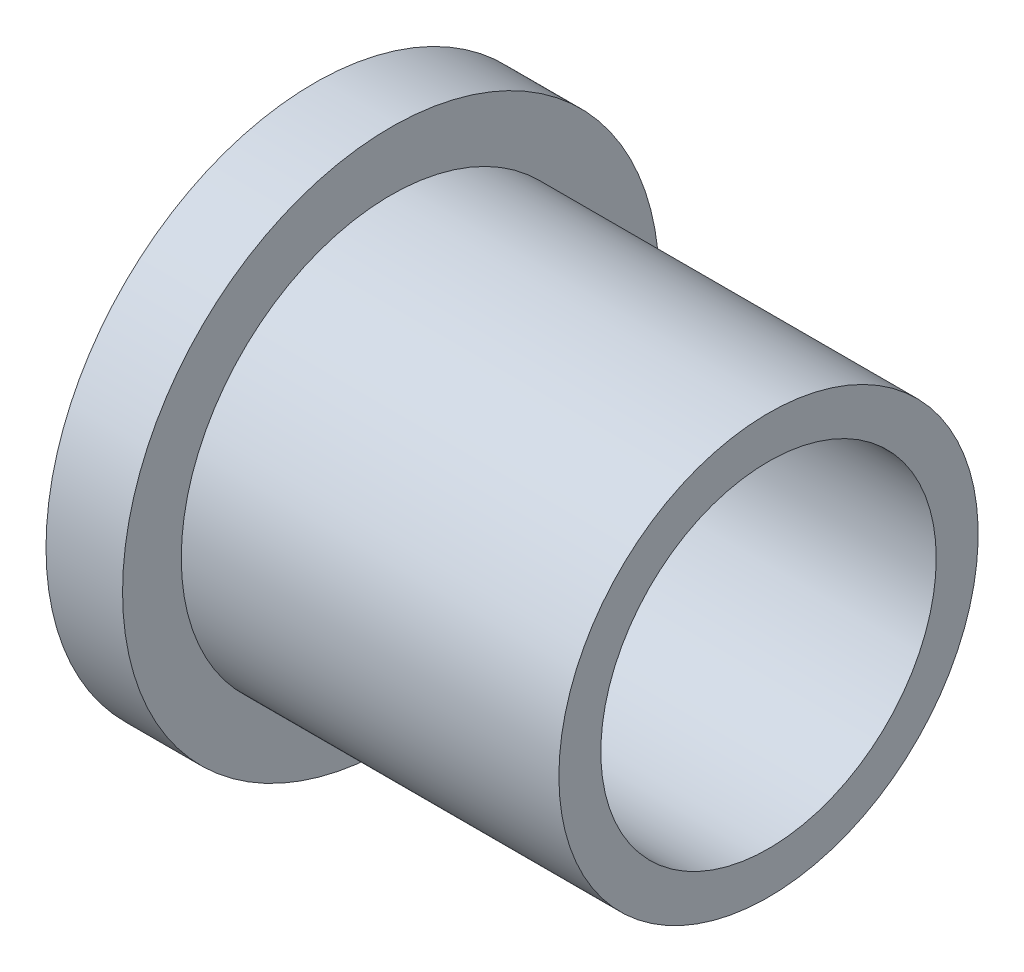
from build123d import *

# Parameters (mm, degrees)
SKETCH2_R          = 10
CUT_EXTRUDE1_DEPTH = 36.289305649


with BuildPart() as part:
    # Sketch1 → Revolve1 (revolve)
    with BuildSketch(Plane.XY, mode=Mode.PRIVATE) as revolve1_sk:
        Polygon((-10.060536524, 12.5), (12.454682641, 12.5), (12.454682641, 0), (-10.060536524, 0), (-14.625477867, 0), (-14.625477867, 16), (-10.060536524, 16), align=None)
    revolve(revolve1_sk.sketch.rotate(Axis((-46.657439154, 0, 0), (1, 0, 0)), 90), axis=Axis((-46.657439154, 0, 0), (1, 0, 0)))

    # Sketch2 → Cut-Extrude1 (cut, through all)
    with BuildSketch(Plane(origin=(12.454682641, 0, 0), x_dir=(0, 0, -1), z_dir=(1, 0, 0))):
        Circle(SKETCH2_R)
    extrude(amount=-CUT_EXTRUDE1_DEPTH, mode=Mode.SUBTRACT)


solid = part.part
